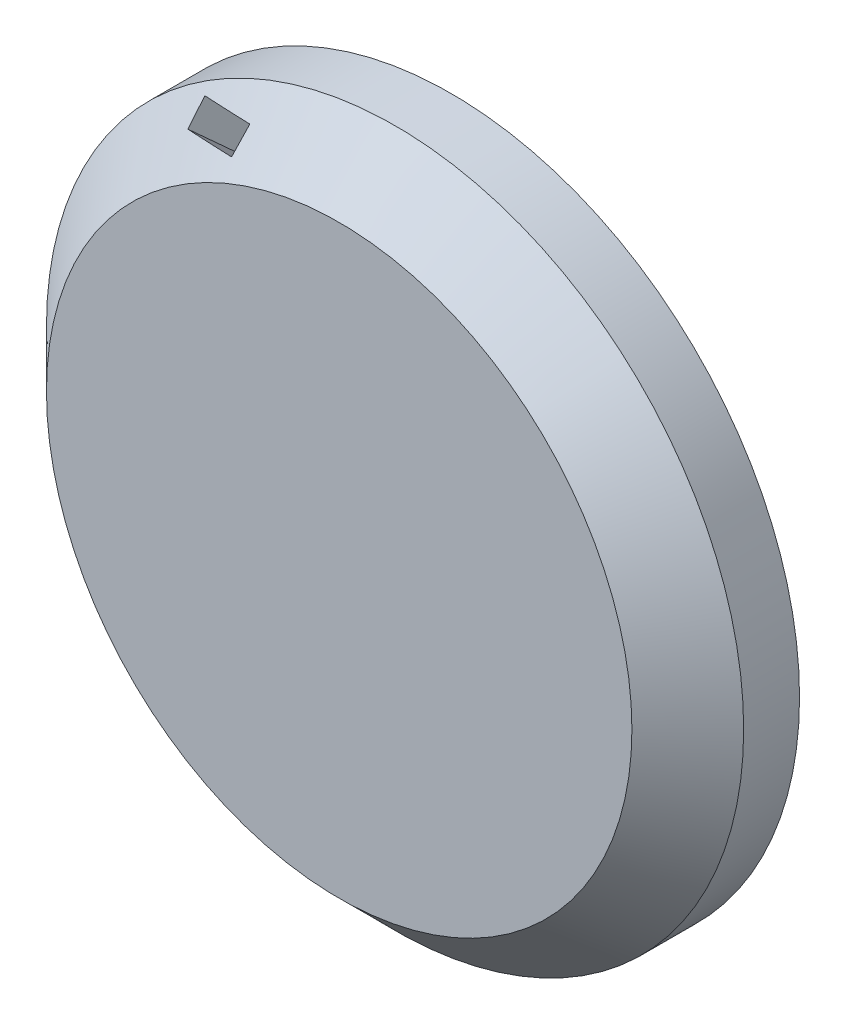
ISO-10303-21;
HEADER;
FILE_DESCRIPTION(('STEP AP214'),'2;1');
FILE_NAME('part.step','',(''),(''),'','','');
FILE_SCHEMA(('AUTOMOTIVE_DESIGN { 1 0 10303 214 1 1 1 1 }'));
ENDSEC;
DATA;
#1=APPLICATION_CONTEXT('core data for automotive mechanical design processes');
#2=APPLICATION_PROTOCOL_DEFINITION('international standard','automotive_design',2000,#1);
#3=PRODUCT_CONTEXT('',#1,'mechanical');
#4=PRODUCT('Part','Part','',(#3));
#5=PRODUCT_RELATED_PRODUCT_CATEGORY('part','',(#4));
#6=PRODUCT_DEFINITION_FORMATION('','',#4);
#7=PRODUCT_DEFINITION_CONTEXT('part definition',#1,'design');
#8=PRODUCT_DEFINITION('design','',#6,#7);
#9=PRODUCT_DEFINITION_SHAPE('','',#8);
#10=(LENGTH_UNIT() NAMED_UNIT(*) SI_UNIT(.MILLI.,.METRE.));
#11=(NAMED_UNIT(*) PLANE_ANGLE_UNIT() SI_UNIT($,.RADIAN.));
#12=(NAMED_UNIT(*) SI_UNIT($,.STERADIAN.) SOLID_ANGLE_UNIT());
#13=UNCERTAINTY_MEASURE_WITH_UNIT(LENGTH_MEASURE(1.E-05),#10,'distance_accuracy_value','');
#14=(GEOMETRIC_REPRESENTATION_CONTEXT(3) GLOBAL_UNCERTAINTY_ASSIGNED_CONTEXT((#13)) GLOBAL_UNIT_ASSIGNED_CONTEXT((#10,
#11,#12)) REPRESENTATION_CONTEXT('',''));
#15=CARTESIAN_POINT('',(0.,0.,0.));
#16=DIRECTION('',(0.,0.,1.));
#17=DIRECTION('',(1.,0.,0.));
#18=AXIS2_PLACEMENT_3D('',#15,#16,#17);
#19=CARTESIAN_POINT('',(0.,0.,-20.));
#20=DIRECTION('',(0.,0.,1.));
#21=DIRECTION('',(1.,0.,0.));
#22=AXIS2_PLACEMENT_3D('',#19,#20,#21);
#23=CYLINDRICAL_SURFACE('',#22,62.3893375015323);
#24=CARTESIAN_POINT('',(0.,0.,-10.));
#25=DIRECTION('',(0.,0.,1.));
#26=DIRECTION('',(1.,0.,0.));
#27=AXIS2_PLACEMENT_3D('',#24,#25,#26);
#28=CIRCLE('',#27,62.3893375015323);
#29=CARTESIAN_POINT('',(62.3893375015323,0.,-10.));
#30=VERTEX_POINT('',#29);
#31=EDGE_CURVE('E112',#30,#30,#28,.F.);
#32=ORIENTED_EDGE('',*,*,#31,.T.);
#33=EDGE_LOOP('',(#32));
#34=FACE_BOUND('',#33,.T.);
#35=CARTESIAN_POINT('',(0.,0.,-20.));
#36=DIRECTION('',(0.,0.,1.));
#37=DIRECTION('',(1.,0.,0.));
#38=AXIS2_PLACEMENT_3D('',#35,#36,#37);
#39=CIRCLE('',#38,62.3893375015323);
#40=CARTESIAN_POINT('',(62.3893375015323,0.,-20.));
#41=VERTEX_POINT('',#40);
#42=EDGE_CURVE('E103',#41,#41,#39,.T.);
#43=ORIENTED_EDGE('',*,*,#42,.T.);
#44=EDGE_LOOP('',(#43));
#45=FACE_BOUND('',#44,.T.);
#46=ADVANCED_FACE('F31',(#34,#45),#23,.T.);
#47=CARTESIAN_POINT('',(0.,0.,-20.));
#48=DIRECTION('',(0.,0.,1.));
#49=DIRECTION('',(1.,0.,0.));
#50=AXIS2_PLACEMENT_3D('',#47,#48,#49);
#51=PLANE('',#50);
#52=ORIENTED_EDGE('',*,*,#42,.F.);
#53=EDGE_LOOP('',(#52));
#54=FACE_BOUND('',#53,.T.);
#55=ADVANCED_FACE('F135',(#54),#51,.F.);
#56=CARTESIAN_POINT('',(0.,0.,0.));
#57=DIRECTION('',(0.,0.,1.));
#58=DIRECTION('',(1.,0.,0.));
#59=AXIS2_PLACEMENT_3D('',#56,#57,#58);
#60=PLANE('',#59);
#61=CARTESIAN_POINT('',(0.,0.,0.));
#62=DIRECTION('',(0.,0.,1.));
#63=DIRECTION('',(1.,0.,0.));
#64=AXIS2_PLACEMENT_3D('',#61,#62,#63);
#65=CIRCLE('',#64,52.3893375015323);
#66=CARTESIAN_POINT('',(52.3893375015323,0.,0.));
#67=VERTEX_POINT('',#66);
#68=EDGE_CURVE('E109',#67,#67,#65,.T.);
#69=ORIENTED_EDGE('',*,*,#68,.T.);
#70=EDGE_LOOP('',(#69));
#71=FACE_BOUND('',#70,.T.);
#72=ADVANCED_FACE('F138',(#71),#60,.T.);
#73=CARTESIAN_POINT('',(0.,0.,0.));
#74=DIRECTION('',(0.,0.,-1.));
#75=DIRECTION('',(-1.,0.,0.));
#76=AXIS2_PLACEMENT_3D('',#73,#74,#75);
#77=CONICAL_SURFACE('',#76,52.3893375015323,0.785398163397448);
#78=CARTESIAN_POINT('',(-32.5776978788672,47.8226782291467,-5.4752885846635));
#79=CARTESIAN_POINT('',(-31.6293906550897,48.0921702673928,-5.16410598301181));
#80=CARTESIAN_POINT('',(-30.6746421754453,48.3520314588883,-4.86404412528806));
#81=CARTESIAN_POINT('',(-28.7538623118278,48.8510132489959,-4.28786958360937));
#82=CARTESIAN_POINT('',(-27.7878451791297,49.0901573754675,-4.01172973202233));
#83=CARTESIAN_POINT('',(-25.8438555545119,49.5468723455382,-3.4843607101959));
#84=CARTESIAN_POINT('',(-24.8658820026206,49.7644412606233,-3.23313376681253));
#85=CARTESIAN_POINT('',(-22.897676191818,50.1770545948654,-2.75668892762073));
#86=CARTESIAN_POINT('',(-21.9074311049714,50.3720727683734,-2.53150133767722));
#87=CARTESIAN_POINT('',(-20.9119845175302,50.5550993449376,-2.32016045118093));
#88=B_SPLINE_CURVE_WITH_KNOTS('',3,(#78,#79,#80,#81,#82,#83,#84,#85,#86,#87),.UNSPECIFIED.,.F.,
.F.,(4,2,2,2,4),(0.,3.10135554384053,6.199141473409,9.29720405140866,12.3988367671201),.UNSPECIFIED.);
#89=CARTESIAN_POINT('',(-32.5381969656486,47.8338968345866,-5.4623344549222));
#90=VERTEX_POINT('',#89);
#91=CARTESIAN_POINT('',(-21.7635705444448,50.3953614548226,-2.50460987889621));
#92=VERTEX_POINT('',#91);
#93=EDGE_CURVE('E115',#90,#92,#88,.T.);
#94=ORIENTED_EDGE('',*,*,#93,.F.);
#95=CARTESIAN_POINT('',(-32.5651558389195,51.4999021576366,-8.54283213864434));
#96=CARTESIAN_POINT('',(-32.5635443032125,51.1877190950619,-8.27811405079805));
#97=CARTESIAN_POINT('',(-32.561764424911,50.8752483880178,-8.01373605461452));
#98=CARTESIAN_POINT('',(-32.5578537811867,50.2497113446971,-7.48569233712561));
#99=CARTESIAN_POINT('',(-32.5557230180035,49.9366450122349,-7.22202661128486));
#100=CARTESIAN_POINT('',(-32.5510963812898,49.3098922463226,-6.69543602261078));
#101=CARTESIAN_POINT('',(-32.548600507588,48.9962058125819,-6.432511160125));
#102=CARTESIAN_POINT('',(-32.5432282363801,48.3681870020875,-5.90743386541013));
#103=CARTESIAN_POINT('',(-32.5403518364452,48.0538546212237,-5.64528143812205));
#104=CARTESIAN_POINT('',(-32.5372774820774,47.7391882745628,-5.38353262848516));
#105=B_SPLINE_CURVE_WITH_KNOTS('',3,(#95,#96,#97,#98,#99,#100,#101,#102,#103,#104),
.UNSPECIFIED.,.F.,.F.,(4,2,2,2,4),(0.,1.22793665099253,2.45586546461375,3.6837948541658,
4.91173208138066),.UNSPECIFIED.);
#106=CARTESIAN_POINT('',(-32.5650431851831,51.4781299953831,-8.52437118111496));
#107=VERTEX_POINT('',#106);
#108=EDGE_CURVE('E11',#107,#90,#105,.T.);
#109=ORIENTED_EDGE('',*,*,#108,.F.);
#110=CARTESIAN_POINT('',(-20.2787454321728,54.1528334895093,-5.43588961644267));
#111=CARTESIAN_POINT('',(-21.3266003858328,53.9771250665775,-5.63878022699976));
#112=CARTESIAN_POINT('',(-22.3694376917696,53.7887347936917,-5.85631457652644));
#113=CARTESIAN_POINT('',(-24.4429856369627,53.3879800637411,-6.31906627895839));
#114=CARTESIAN_POINT('',(-25.4737090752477,53.1756440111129,-6.56425083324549));
#115=CARTESIAN_POINT('',(-27.5233153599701,52.7279882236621,-7.08115921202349));
#116=CARTESIAN_POINT('',(-28.5421992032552,52.492670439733,-7.35288078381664));
#117=CARTESIAN_POINT('',(-30.5687974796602,51.9999431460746,-7.9218332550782));
#118=CARTESIAN_POINT('',(-31.5764973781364,51.7425079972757,-8.21909375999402));
#119=CARTESIAN_POINT('',(-32.5776978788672,51.474746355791,-8.52827827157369));
#120=B_SPLINE_CURVE_WITH_KNOTS('',3,(#110,#111,#112,#113,#114,#115,#116,#117,#118,#119),
.UNSPECIFIED.,.F.,.F.,(4,2,2,2,4),(0.,3.24478685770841,6.48576445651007,9.72646717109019,
12.9709786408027),.UNSPECIFIED.);
#121=CARTESIAN_POINT('',(-21.7121554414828,53.9040420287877,-5.72316925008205));
#122=VERTEX_POINT('',#121);
#123=EDGE_CURVE('E44',#122,#107,#120,.T.);
#124=ORIENTED_EDGE('',*,*,#123,.F.);
#125=CARTESIAN_POINT('',(-21.7662534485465,50.1932204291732,-2.32016045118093));
#126=CARTESIAN_POINT('',(-21.7618887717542,50.5240430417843,-2.62193760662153));
#127=CARTESIAN_POINT('',(-21.7573979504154,50.85463968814,-2.92396057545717));
#128=CARTESIAN_POINT('',(-21.7481753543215,51.5153999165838,-3.52847480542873));
#129=CARTESIAN_POINT('',(-21.7434435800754,51.8455634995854,-3.83096606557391));
#130=CARTESIAN_POINT('',(-21.7337503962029,52.5054778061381,-4.43639476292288));
#131=CARTESIAN_POINT('',(-21.7287889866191,52.8352285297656,-4.73933220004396));
#132=CARTESIAN_POINT('',(-21.7186468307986,53.4943357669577,-5.34563335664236));
#133=CARTESIAN_POINT('',(-21.7134660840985,53.8236922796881,-5.6489970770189));
#134=CARTESIAN_POINT('',(-21.7081808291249,54.1528602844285,-5.95256332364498));
#135=B_SPLINE_CURVE_WITH_KNOTS('',3,(#125,#126,#127,#128,#129,#130,#131,#132,#133,#134),
.UNSPECIFIED.,.F.,.F.,(4,2,2,2,4),(0.,1.34342411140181,2.6868453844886,4.03026640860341,
5.37369027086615),.UNSPECIFIED.);
#136=EDGE_CURVE('E121',#92,#122,#135,.T.);
#137=ORIENTED_EDGE('',*,*,#136,.F.);
#138=EDGE_LOOP('',(#94,#109,#124,#137));
#139=FACE_BOUND('',#138,.T.);
#140=ORIENTED_EDGE('',*,*,#31,.F.);
#141=EDGE_LOOP('',(#140));
#142=FACE_BOUND('',#141,.T.);
#143=ORIENTED_EDGE('',*,*,#68,.F.);
#144=EDGE_LOOP('',(#143));
#145=FACE_BOUND('',#144,.T.);
#146=ADVANCED_FACE('F33',(#139,#142,#145),#77,.T.);
#147=CARTESIAN_POINT('',(-29.0419639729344,41.778243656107,-12.4548004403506));
#148=DIRECTION('',(-0.935414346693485,-0.231455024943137,-0.267261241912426));
#149=DIRECTION('',(-0.27472112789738,0.,0.961523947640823));
#150=AXIS2_PLACEMENT_3D('',#147,#148,#149);
#151=PLANE('',#150);
#152=ORIENTED_EDGE('',*,*,#108,.T.);
#153=DIRECTION('',(-0.353553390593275,0.612372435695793,0.707106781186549));
#154=VECTOR('',#153,1.);
#155=CARTESIAN_POINT('',(-29.0419639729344,41.778243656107,-12.4548004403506));
#156=LINE('',#155,#154);
#157=CARTESIAN_POINT('',(-29.0419639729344,41.778243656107,-12.4548004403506));
#158=VERTEX_POINT('',#157);
#159=EDGE_CURVE('E76',#158,#90,#156,.T.);
#160=ORIENTED_EDGE('',*,*,#159,.F.);
#161=DIRECTION('',(0.,-0.755928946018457,0.654653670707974));
#162=VECTOR('',#161,1.);
#163=CARTESIAN_POINT('',(-29.0419639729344,41.778243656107,-12.4548004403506));
#164=LINE('',#163,#162);
#165=CARTESIAN_POINT('',(-29.0419639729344,45.3759778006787,-15.5705296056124));
#166=VERTEX_POINT('',#165);
#167=EDGE_CURVE('E80',#166,#158,#164,.T.);
#168=ORIENTED_EDGE('',*,*,#167,.F.);
#169=DIRECTION('',(-0.353553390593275,0.612372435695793,0.707106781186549));
#170=VECTOR('',#169,1.);
#171=CARTESIAN_POINT('',(-29.0419639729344,45.3759778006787,-15.5705296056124));
#172=LINE('',#171,#170);
#173=EDGE_CURVE('E101',#166,#107,#172,.T.);
#174=ORIENTED_EDGE('',*,*,#173,.T.);
#175=EDGE_LOOP('',(#152,#160,#168,#174));
#176=FACE_BOUND('',#175,.T.);
#177=ADVANCED_FACE('F78',(#176),#151,.F.);
#178=CARTESIAN_POINT('',(-29.0419639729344,45.3759778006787,-15.5705296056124));
#179=DIRECTION('',(0.,0.755928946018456,-0.654653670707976));
#180=DIRECTION('',(0.,0.654653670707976,0.755928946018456));
#181=AXIS2_PLACEMENT_3D('',#178,#179,#180);
#182=PLANE('',#181);
#183=DIRECTION('',(-0.353553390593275,0.612372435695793,0.707106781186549));
#184=VECTOR('',#183,1.);
#185=CARTESIAN_POINT('',(-18.3201613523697,48.0289359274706,-12.5071574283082));
#186=LINE('',#185,#184);
#187=CARTESIAN_POINT('',(-18.3201613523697,48.0289359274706,-12.5071574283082));
#188=VERTEX_POINT('',#187);
#189=EDGE_CURVE('E104',#188,#122,#186,.T.);
#190=ORIENTED_EDGE('',*,*,#189,.T.);
#191=ORIENTED_EDGE('',*,*,#123,.T.);
#192=ORIENTED_EDGE('',*,*,#173,.F.);
#193=DIRECTION('',(-0.935414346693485,-0.231455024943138,-0.267261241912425));
#194=VECTOR('',#193,1.);
#195=CARTESIAN_POINT('',(-29.0419639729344,45.3759778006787,-15.5705296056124));
#196=LINE('',#195,#194);
#197=EDGE_CURVE('E84',#188,#166,#196,.T.);
#198=ORIENTED_EDGE('',*,*,#197,.F.);
#199=EDGE_LOOP('',(#190,#191,#192,#198));
#200=FACE_BOUND('',#199,.T.);
#201=ADVANCED_FACE('F134',(#200),#182,.F.);
#202=CARTESIAN_POINT('',(-18.3201613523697,44.4312017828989,-9.39142826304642));
#203=DIRECTION('',(0.935414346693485,0.231455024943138,0.267261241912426));
#204=DIRECTION('',(0.274721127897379,0.,-0.961523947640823));
#205=AXIS2_PLACEMENT_3D('',#202,#203,#204);
#206=PLANE('',#205);
#207=ORIENTED_EDGE('',*,*,#136,.T.);
#208=ORIENTED_EDGE('',*,*,#189,.F.);
#209=DIRECTION('',(0.,0.755928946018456,-0.654653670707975));
#210=VECTOR('',#209,1.);
#211=CARTESIAN_POINT('',(-18.3201613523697,44.4312017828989,-9.39142826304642));
#212=LINE('',#211,#210);
#213=CARTESIAN_POINT('',(-18.3201613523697,44.4312017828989,-9.39142826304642));
#214=VERTEX_POINT('',#213);
#215=EDGE_CURVE('E93',#214,#188,#212,.T.);
#216=ORIENTED_EDGE('',*,*,#215,.F.);
#217=DIRECTION('',(-0.353553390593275,0.612372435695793,0.707106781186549));
#218=VECTOR('',#217,1.);
#219=CARTESIAN_POINT('',(-18.3201613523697,44.4312017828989,-9.39142826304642));
#220=LINE('',#219,#218);
#221=EDGE_CURVE('E83',#214,#92,#220,.T.);
#222=ORIENTED_EDGE('',*,*,#221,.T.);
#223=EDGE_LOOP('',(#207,#208,#216,#222));
#224=FACE_BOUND('',#223,.T.);
#225=ADVANCED_FACE('F128',(#224),#206,.F.);
#226=CARTESIAN_POINT('',(-29.0419639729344,41.778243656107,-12.4548004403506));
#227=DIRECTION('',(0.,-0.755928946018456,0.654653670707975));
#228=DIRECTION('',(0.,-0.654653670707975,-0.755928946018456));
#229=AXIS2_PLACEMENT_3D('',#226,#227,#228);
#230=PLANE('',#229);
#231=ORIENTED_EDGE('',*,*,#159,.T.);
#232=ORIENTED_EDGE('',*,*,#93,.T.);
#233=ORIENTED_EDGE('',*,*,#221,.F.);
#234=DIRECTION('',(0.935414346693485,0.231455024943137,0.267261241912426));
#235=VECTOR('',#234,1.);
#236=CARTESIAN_POINT('',(-29.0419639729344,41.778243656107,-12.4548004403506));
#237=LINE('',#236,#235);
#238=EDGE_CURVE('E87',#158,#214,#237,.T.);
#239=ORIENTED_EDGE('',*,*,#238,.F.);
#240=EDGE_LOOP('',(#231,#232,#233,#239));
#241=FACE_BOUND('',#240,.T.);
#242=ADVANCED_FACE('F88',(#241),#230,.F.);
#243=CARTESIAN_POINT('',(-29.0419639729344,41.778243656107,-12.4548004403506));
#244=DIRECTION('',(0.353553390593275,-0.612372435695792,-0.70710678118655));
#245=DIRECTION('',(0.,0.755928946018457,-0.654653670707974));
#246=AXIS2_PLACEMENT_3D('',#243,#244,#245);
#247=PLANE('',#246);
#248=ORIENTED_EDGE('',*,*,#167,.T.);
#249=ORIENTED_EDGE('',*,*,#238,.T.);
#250=ORIENTED_EDGE('',*,*,#215,.T.);
#251=ORIENTED_EDGE('',*,*,#197,.T.);
#252=EDGE_LOOP('',(#248,#249,#250,#251));
#253=FACE_BOUND('',#252,.T.);
#254=ADVANCED_FACE('F95',(#253),#247,.F.);
#255=CLOSED_SHELL('',(#46,#55,#72,#146,#177,#201,#225,#242,#254));
#256=MANIFOLD_SOLID_BREP('B2',#255);
#257=ADVANCED_BREP_SHAPE_REPRESENTATION('',(#18,#256),#14);
#258=SHAPE_DEFINITION_REPRESENTATION(#9,#257);
ENDSEC;
END-ISO-10303-21;
